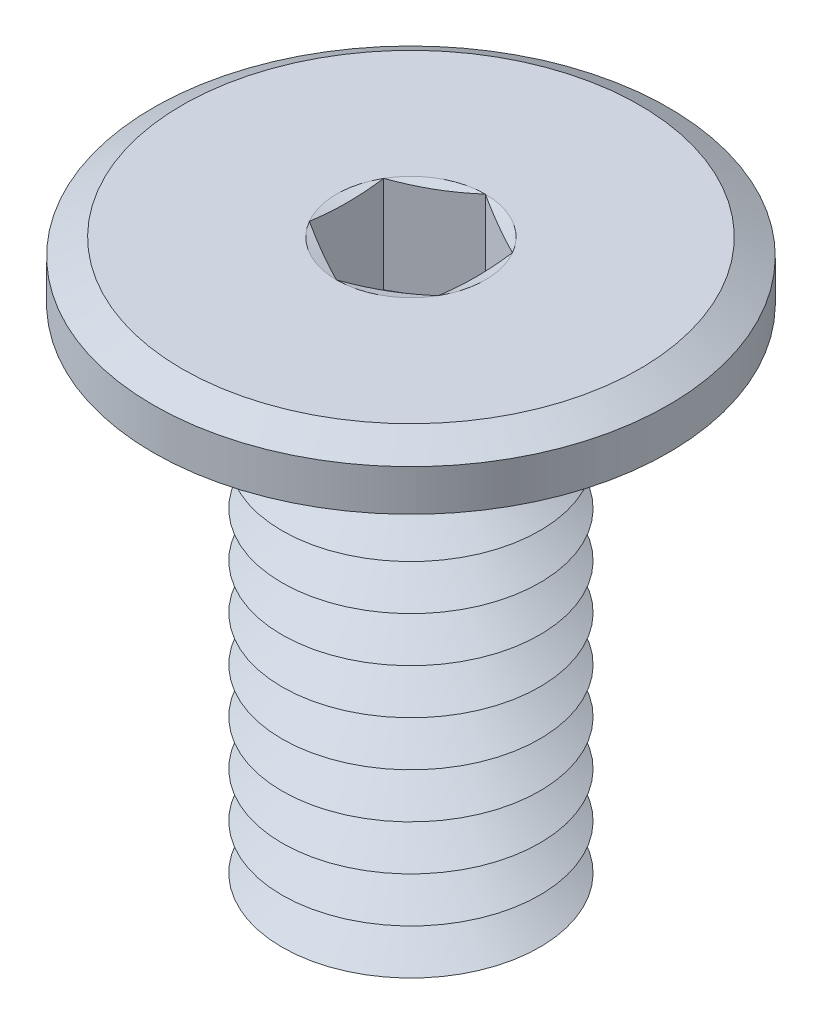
from build123d import *

# Parameters (mm, degrees)
SKETCH1_R           = 4
BOSS_EXTRUDE1_DEPTH = 0.9
SKETCH2_R           = 2
BOSS_EXTRUDE2_DEPTH = 8
LPATTERN1_COUNT     = 10
LPATTERN1_PITCH     = 0.7
FILLET1_R           = 0.2
CHAMFER2_SIZE       = 0.45
CHAMFER2_SIZE2      = 0.259807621
CUT_EXTRUDE1_DEPTH  = 1.5


with BuildPart() as part:
    # Sketch1 → Boss-Extrude1 (new body)
    with BuildSketch(Plane(origin=(0, 0, 0), x_dir=(1, 0, 0), z_dir=(0, 1, 0))):
        with Locations(Location((0, 0, 0), (0, 0, 270))):
            Circle(SKETCH1_R)
    extrude(amount=-BOSS_EXTRUDE1_DEPTH)

    # Sketch2 → Boss-Extrude2 (add)
    with BuildSketch(Plane.XZ.offset(0.9)):
        with Locations(Location((0, 0, 0), (0, 0, 270))):
            Circle(SKETCH2_R)
    extrude(amount=BOSS_EXTRUDE2_DEPTH)

    # Sketch5 → Cut-Revolve1 (revolve, cut)
    with BuildSketch(Plane(origin=(0, 0, 0), x_dir=(0, 0, -1), z_dir=(1, 0, 0))):
        Polygon((-2, -9.25), (-1.393782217, -8.9), (-2, -8.55), align=None)
    cut_revolve1 = revolve(axis=Axis((0, 0.990593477, 0), (0, -1, 0)), mode=Mode.SUBTRACT)

    # LPattern1: Cut-Revolve1 ×10
    with Locations(*[(0, i * LPATTERN1_PITCH, 0) for i in range(1, LPATTERN1_COUNT)]):
        add(cut_revolve1, mode=Mode.SUBTRACT)

    # Fillet1
    fillet1_edges = [part.edges().sort_by_distance(p)[0] for p in [
        (0, -0.9, 2),
    ]]
    fillet(fillet1_edges, radius=FILLET1_R)

    # Chamfer2
    chamfer2_edges = [part.edges().sort_by_distance(p)[0] for p in [
        (0, 0, -4),
    ]]
    chamfer2_side = [part.faces().sort_by_distance(p)[0] for p in [
        (0, 0, 0),
    ]]
    chamfer(chamfer2_edges, length=CHAMFER2_SIZE, length2=CHAMFER2_SIZE2, reference=chamfer2_side[0])

    # Sketch6 → Cut-Extrude1 (cut)
    with BuildSketch(Plane(origin=(0, 0, 0), x_dir=(1, 0, 0), z_dir=(0, 1, 0))):
        Polygon((0, 1.154700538), (-1, 0.577350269), (-1, -0.577350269), (0, -1.154700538), (1, -0.577350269), (1, 0.577350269), align=None)
    extrude(amount=-CUT_EXTRUDE1_DEPTH, mode=Mode.SUBTRACT)

    # Cut-Extrude2 cone 1 section (on through the dimple's axis) → Cut-Extrude2 (revolve, cut)
    with BuildSketch(Plane(origin=(0, -1.5, 0), x_dir=(0, 0, 1), z_dir=(1, 0, 0))):
        Polygon((0, 0), (1, 0), (0, 0.577350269), align=None)
    revolve(axis=Axis((0, -1.5, 0), (0, -1, 0)), mode=Mode.SUBTRACT)

    # Cut-Extrude3 cone 1 section (on through the dimple's axis) → Cut-Extrude3 (revolve, cut)
    with BuildSketch(Plane(origin=(0, 0, 0), x_dir=(0, 0, 1), z_dir=(1, 0, 0))):
        Polygon((0, 0), (1.154700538, 0), (0, 0.309401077), align=None)
    revolve(axis=Axis((0, 0, 0), (0, -1, 0)), mode=Mode.SUBTRACT)


solid = part.part
